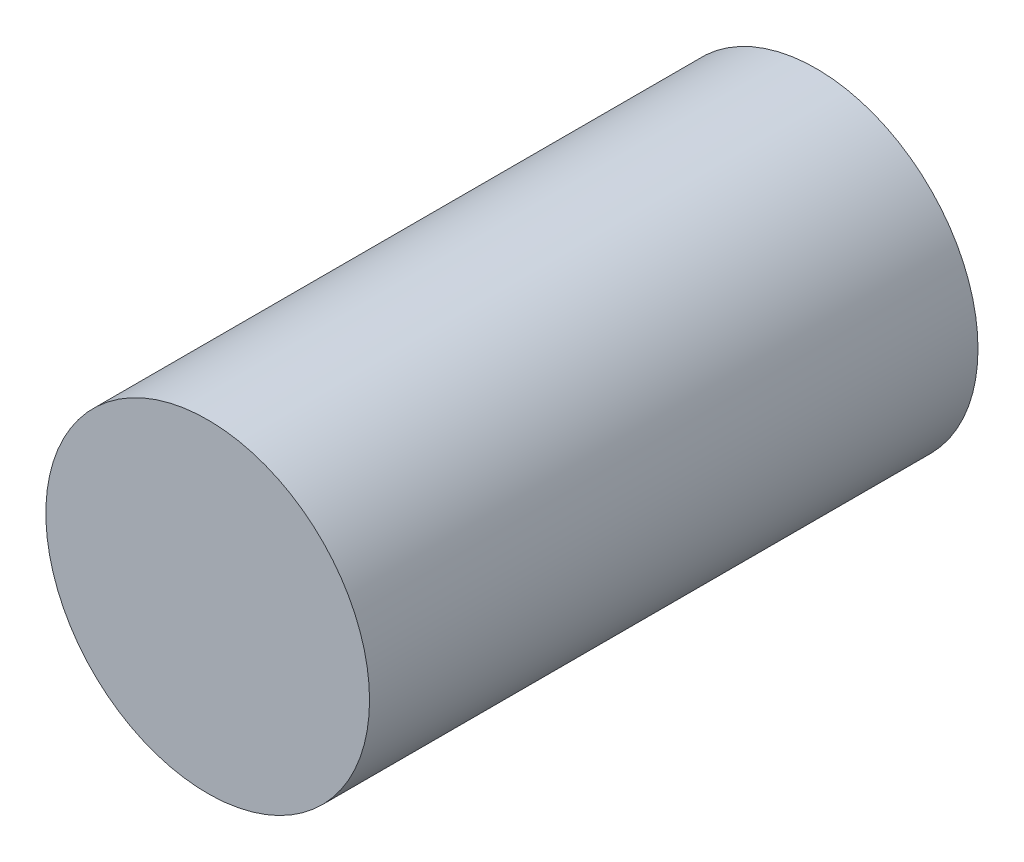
ISO-10303-21;
HEADER;
FILE_DESCRIPTION(('STEP AP214'),'2;1');
FILE_NAME('part.step','',(''),(''),'','','');
FILE_SCHEMA(('AUTOMOTIVE_DESIGN { 1 0 10303 214 1 1 1 1 }'));
ENDSEC;
DATA;
#1=APPLICATION_CONTEXT('core data for automotive mechanical design processes');
#2=APPLICATION_PROTOCOL_DEFINITION('international standard','automotive_design',2000,#1);
#3=PRODUCT_CONTEXT('',#1,'mechanical');
#4=PRODUCT('Part','Part','',(#3));
#5=PRODUCT_RELATED_PRODUCT_CATEGORY('part','',(#4));
#6=PRODUCT_DEFINITION_FORMATION('','',#4);
#7=PRODUCT_DEFINITION_CONTEXT('part definition',#1,'design');
#8=PRODUCT_DEFINITION('design','',#6,#7);
#9=PRODUCT_DEFINITION_SHAPE('','',#8);
#10=(LENGTH_UNIT() NAMED_UNIT(*) SI_UNIT(.MILLI.,.METRE.));
#11=(NAMED_UNIT(*) PLANE_ANGLE_UNIT() SI_UNIT($,.RADIAN.));
#12=(NAMED_UNIT(*) SI_UNIT($,.STERADIAN.) SOLID_ANGLE_UNIT());
#13=UNCERTAINTY_MEASURE_WITH_UNIT(LENGTH_MEASURE(1.E-05),#10,'distance_accuracy_value','');
#14=(GEOMETRIC_REPRESENTATION_CONTEXT(3) GLOBAL_UNCERTAINTY_ASSIGNED_CONTEXT((#13)) GLOBAL_UNIT_ASSIGNED_CONTEXT((#10,
#11,#12)) REPRESENTATION_CONTEXT('',''));
#15=CARTESIAN_POINT('',(0.,0.,0.));
#16=DIRECTION('',(0.,0.,1.));
#17=DIRECTION('',(1.,0.,0.));
#18=AXIS2_PLACEMENT_3D('',#15,#16,#17);
#19=CARTESIAN_POINT('',(0.,0.,12.5));
#20=DIRECTION('',(0.,0.,-1.));
#21=DIRECTION('',(-1.,0.,0.));
#22=AXIS2_PLACEMENT_3D('',#19,#20,#21);
#23=CYLINDRICAL_SURFACE('',#22,3.325);
#24=CARTESIAN_POINT('',(0.,0.,12.5));
#25=DIRECTION('',(0.,0.,1.));
#26=DIRECTION('',(1.,0.,0.));
#27=AXIS2_PLACEMENT_3D('',#24,#25,#26);
#28=CIRCLE('',#27,3.325);
#29=CARTESIAN_POINT('',(3.325,0.,12.5));
#30=VERTEX_POINT('',#29);
#31=EDGE_CURVE('E10',#30,#30,#28,.T.);
#32=ORIENTED_EDGE('',*,*,#31,.F.);
#33=EDGE_LOOP('',(#32));
#34=FACE_BOUND('',#33,.T.);
#35=CARTESIAN_POINT('',(0.,0.,0.));
#36=DIRECTION('',(0.,0.,1.));
#37=DIRECTION('',(1.,0.,0.));
#38=AXIS2_PLACEMENT_3D('',#35,#36,#37);
#39=CIRCLE('',#38,3.325);
#40=CARTESIAN_POINT('',(3.325,0.,0.));
#41=VERTEX_POINT('',#40);
#42=EDGE_CURVE('E40',#41,#41,#39,.T.);
#43=ORIENTED_EDGE('',*,*,#42,.T.);
#44=EDGE_LOOP('',(#43));
#45=FACE_BOUND('',#44,.T.);
#46=ADVANCED_FACE('F37',(#34,#45),#23,.T.);
#47=CARTESIAN_POINT('',(0.,0.,12.5));
#48=DIRECTION('',(0.,0.,1.));
#49=DIRECTION('',(1.,0.,0.));
#50=AXIS2_PLACEMENT_3D('',#47,#48,#49);
#51=PLANE('',#50);
#52=ORIENTED_EDGE('',*,*,#31,.T.);
#53=EDGE_LOOP('',(#52));
#54=FACE_BOUND('',#53,.T.);
#55=ADVANCED_FACE('F52',(#54),#51,.T.);
#56=CARTESIAN_POINT('',(0.,0.,0.));
#57=DIRECTION('',(0.,0.,1.));
#58=DIRECTION('',(1.,0.,0.));
#59=AXIS2_PLACEMENT_3D('',#56,#57,#58);
#60=PLANE('',#59);
#61=ORIENTED_EDGE('',*,*,#42,.F.);
#62=EDGE_LOOP('',(#61));
#63=FACE_BOUND('',#62,.T.);
#64=ADVANCED_FACE('F50',(#63),#60,.F.);
#65=CLOSED_SHELL('',(#46,#55,#64));
#66=MANIFOLD_SOLID_BREP('B2',#65);
#67=ADVANCED_BREP_SHAPE_REPRESENTATION('',(#18,#66),#14);
#68=SHAPE_DEFINITION_REPRESENTATION(#9,#67);
ENDSEC;
END-ISO-10303-21;
